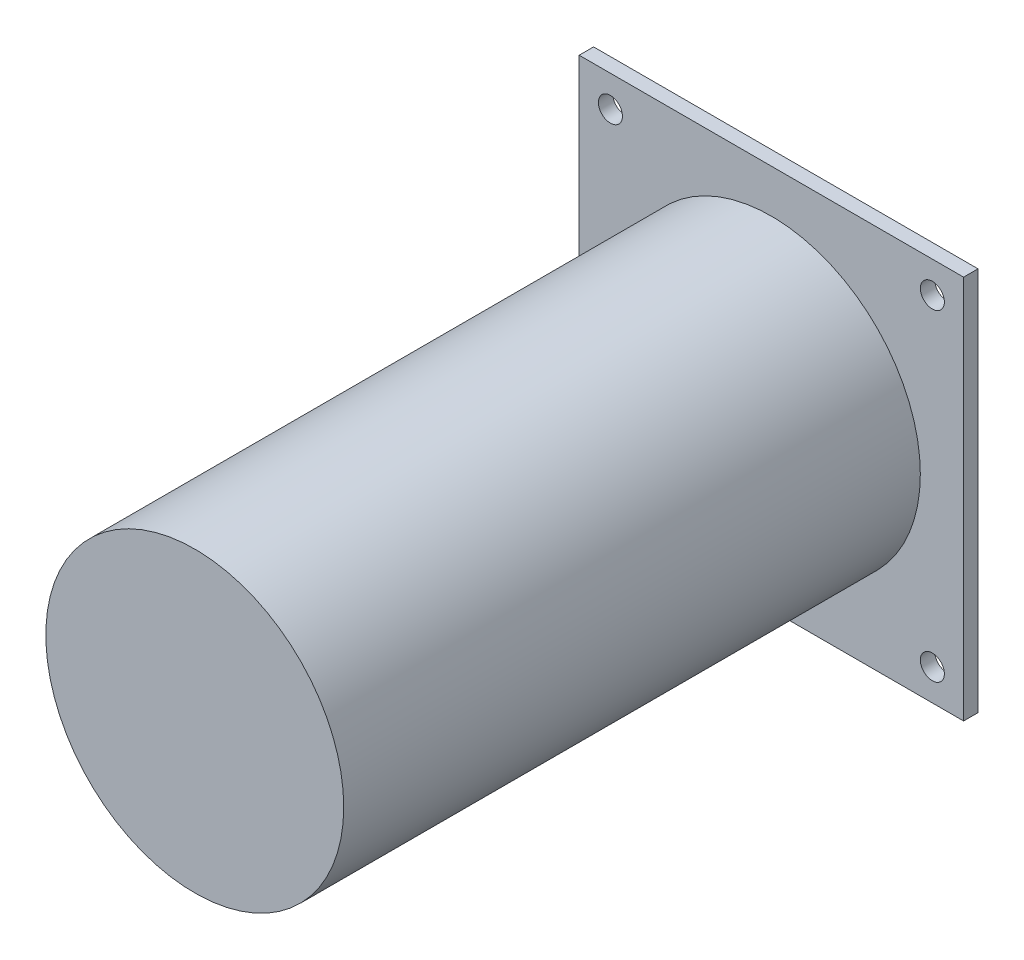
from build123d import *

# Parameters (mm, degrees)
SCHIZZO1_R                   = 31
ESTRUSIONE_ESTRUSIONE1_DEPTH = 120
SCHIZZO2_W                   = 80
SCHIZZO2_H                   = 80
ESTRUSIONE_ESTRUSIONE2_DEPTH = 3
SCHIZZO3_R                   = 6
ESTRUSIONE_ESTRUSIONE3_DEPTH = 9
SCHIZZO4_R                   = 18
ESTRUSIONE_ESTRUSIONE4_DEPTH = 10
SCHIZZO6_W                   = 5
SCHIZZO6_H                   = 8
RACCORDO1_R                  = 1.5
FORO_FILETTATO_M6_1_D        = 5


with BuildPart() as part:
    # Schizzo1 → Estrusione-Estrusione1 (new body)
    with BuildSketch(Plane.XY):
        Circle(SCHIZZO1_R)
    extrude(amount=ESTRUSIONE_ESTRUSIONE1_DEPTH)

    # Schizzo2 → Estrusione-Estrusione2 (add)
    with BuildSketch(Plane(origin=(0, 0, 0), x_dir=(-1, 0, 0), z_dir=(0, 0, -1))):
        Rectangle(SCHIZZO2_W, SCHIZZO2_H)
    extrude(amount=ESTRUSIONE_ESTRUSIONE2_DEPTH)

    # Schizzo3 → Estrusione-Estrusione3 (add)
    with BuildSketch(Plane(origin=(0, 0, -3), x_dir=(-1, 0, 0), z_dir=(0, 0, -1))):
        with Locations(Location((0, 0, 0), (0, 0, 180))):
            Circle(SCHIZZO3_R)
    extrude(amount=ESTRUSIONE_ESTRUSIONE3_DEPTH)

    # Schizzo4 → Estrusione-Estrusione4 (add)
    with BuildSketch(Plane(origin=(0, 0, -12), x_dir=(-1, 0, 0), z_dir=(0, 0, -1))):
        Circle(SCHIZZO4_R)
    extrude(amount=ESTRUSIONE_ESTRUSIONE4_DEPTH)

    # Schizzo6 → Taglia-Rivoluzione5 (revolve, cut)
    with BuildSketch(Plane(origin=(0, 0, 0), x_dir=(0, 0, -1), z_dir=(1, 0, 0)), mode=Mode.PRIVATE) as taglia_rivoluzione5_sk:
        with Locations((17, 18)):
            Rectangle(SCHIZZO6_W, SCHIZZO6_H)
    revolve(taglia_rivoluzione5_sk.sketch.rotate(Axis((0, 0, 0), (0, 0, -1)), 270), axis=Axis((0, 0, 0), (0, 0, -1)), mode=Mode.SUBTRACT)

    # Raccordo1
    raccordo1_edges = [part.edges().sort_by_distance(p)[0] for p in [
        (14, 0, -19.5),
        (14, 0, -14.5),
    ]]
    fillet(raccordo1_edges, radius=RACCORDO1_R)

    # Foro filettato M6-1 (through all)
    with Locations(Plane(origin=(0, 0, -3), x_dir=(-1, 0, 0), z_dir=(0, 0, -1))):
        with Locations((-33.5, 33.5), (-33.5, -33.5), (33.5, -33.5), (33.5, 33.5)):
            Hole(FORO_FILETTATO_M6_1_D / 2)


solid = part.part
